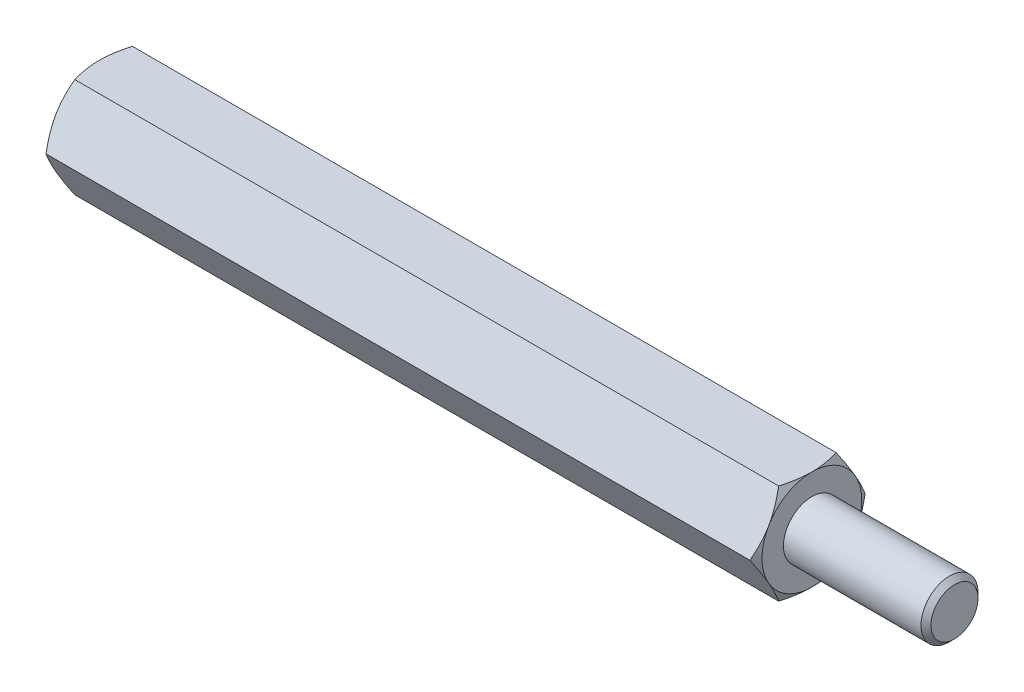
from build123d import *

# Parameters (mm, degrees)
EXTRUDE2_DEPTH = 25
SKETCH3_R      = 1.65
EXTRUDE3_DEPTH = 10
SKETCH5_R      = 2
EXTRUDE4_DEPTH = 10
CHAMFER1_SIZE  = 0.35


with BuildPart() as part:
    # Sketch1 → Extrude2 (new, symmetric)
    with BuildSketch(Plane(origin=(0, 0, 0), x_dir=(0, 0, -1), z_dir=(1, 0, 0))):
        Polygon((2.020725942, 3.5), (-2.020725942, 3.5), (-4.041451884, 0), (-2.020725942, -3.5), (2.020725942, -3.5), (4.041451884, 0), align=None)
    extrude(amount=EXTRUDE2_DEPTH, both=True)

    # Sketch2 → Cut-Revolve1 (revolve, cut)
    with BuildSketch(Plane.XY):
        with BuildLine():
            Line((-25, 3.5), (-23.5, 6.098076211))
            ThreePointArc((-23.5, 6.098076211), (-23.98810136, 7.276457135), (-25, 6.5))
            Line((-25, 6.5), (-25, 3.5))
        make_face()
    cut_revolve1 = revolve(axis=Axis((0, 0, 0), (1, 0, 0)), mode=Mode.SUBTRACT)

    # Mirror1: Cut-Revolve1 across plane
    add(cut_revolve1.mirror(Plane(origin=(0, 0, 0), x_dir=(0, 0, 1), z_dir=(1, 0, 0))), mode=Mode.SUBTRACT)

    # Sketch3 → Extrude3 (cut)
    with BuildSketch(Plane.ZY.offset(25)):
        Circle(SKETCH3_R)
    extrude(amount=-EXTRUDE3_DEPTH, mode=Mode.SUBTRACT)

    # Sketch4 → Cut-Revolve2 (revolve, cut)
    with BuildSketch(Plane.XY, mode=Mode.PRIVATE) as cut_revolve2_sk:
        Polygon((-15, 0), (-15, 1.65), (-14.047372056, 0), align=None)
    revolve(cut_revolve2_sk.sketch.rotate(Axis((-14.047372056, 0, 0), (-1, 0, 0)), 270), axis=Axis((-14.047372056, 0, 0), (-1, 0, 0)), mode=Mode.SUBTRACT)

    # Sketch5 → Extrude4 (add)
    with BuildSketch(Plane(origin=(25, 0, 0), x_dir=(0, 0, -1), z_dir=(1, 0, 0))):
        Circle(SKETCH5_R)
    extrude(amount=EXTRUDE4_DEPTH)

    # Chamfer1
    chamfer1_edges = [part.edges().sort_by_distance(p)[0] for p in [
        (35, 0, 2),
    ]]
    chamfer(chamfer1_edges, length=CHAMFER1_SIZE)


solid = part.part
